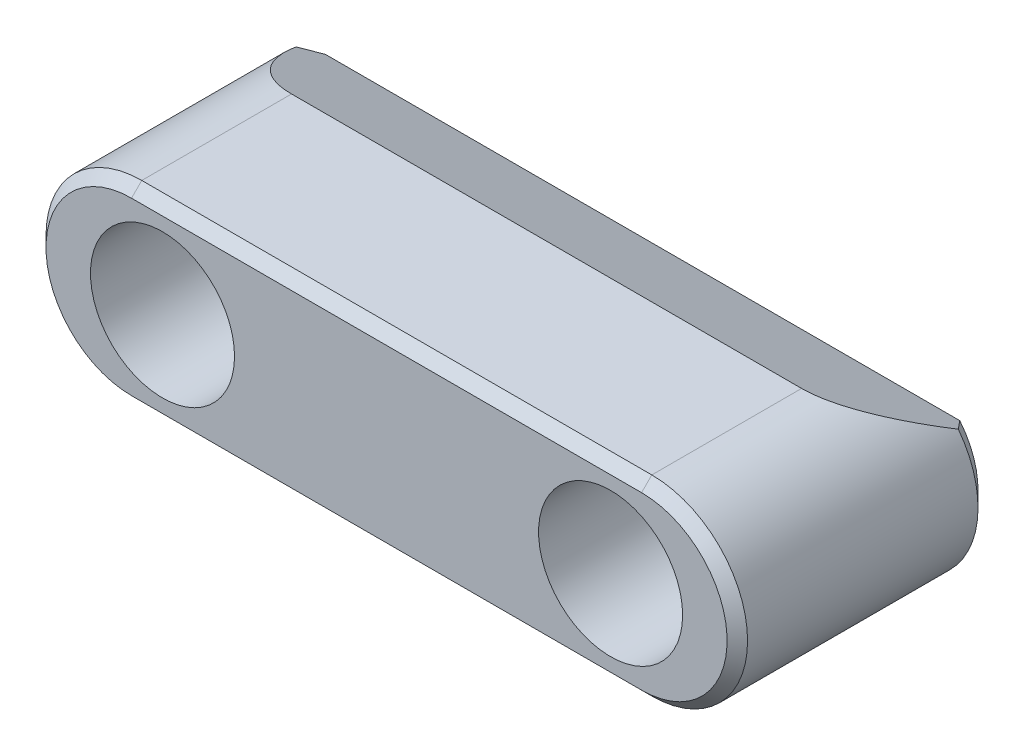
ISO-10303-21;
HEADER;
FILE_DESCRIPTION(('STEP AP214'),'2;1');
FILE_NAME('part.step','',(''),(''),'','','');
FILE_SCHEMA(('AUTOMOTIVE_DESIGN { 1 0 10303 214 1 1 1 1 }'));
ENDSEC;
DATA;
#1=APPLICATION_CONTEXT('core data for automotive mechanical design processes');
#2=APPLICATION_PROTOCOL_DEFINITION('international standard','automotive_design',2000,#1);
#3=PRODUCT_CONTEXT('',#1,'mechanical');
#4=PRODUCT('Part','Part','',(#3));
#5=PRODUCT_RELATED_PRODUCT_CATEGORY('part','',(#4));
#6=PRODUCT_DEFINITION_FORMATION('','',#4);
#7=PRODUCT_DEFINITION_CONTEXT('part definition',#1,'design');
#8=PRODUCT_DEFINITION('design','',#6,#7);
#9=PRODUCT_DEFINITION_SHAPE('','',#8);
#10=(LENGTH_UNIT() NAMED_UNIT(*) SI_UNIT(.MILLI.,.METRE.));
#11=(NAMED_UNIT(*) PLANE_ANGLE_UNIT() SI_UNIT($,.RADIAN.));
#12=(NAMED_UNIT(*) SI_UNIT($,.STERADIAN.) SOLID_ANGLE_UNIT());
#13=UNCERTAINTY_MEASURE_WITH_UNIT(LENGTH_MEASURE(1.E-05),#10,'distance_accuracy_value','');
#14=(GEOMETRIC_REPRESENTATION_CONTEXT(3) GLOBAL_UNCERTAINTY_ASSIGNED_CONTEXT((#13)) GLOBAL_UNIT_ASSIGNED_CONTEXT((#10,
#11,#12)) REPRESENTATION_CONTEXT('',''));
#15=CARTESIAN_POINT('',(0.,0.,0.));
#16=DIRECTION('',(0.,0.,1.));
#17=DIRECTION('',(1.,0.,0.));
#18=AXIS2_PLACEMENT_3D('',#15,#16,#17);
#19=CARTESIAN_POINT('',(-12.6492,0.,-12.7));
#20=DIRECTION('',(0.,0.,1.));
#21=DIRECTION('',(1.,0.,0.));
#22=AXIS2_PLACEMENT_3D('',#19,#20,#21);
#23=CYLINDRICAL_SURFACE('',#22,4.7498);
#24=CARTESIAN_POINT('',(-12.6492,0.,-18.1234789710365));
#25=DIRECTION('',(0.,-0.906307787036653,0.422618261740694));
#26=DIRECTION('',(0.,0.422618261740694,0.906307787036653));
#27=AXIS2_PLACEMENT_3D('',#24,#25,#26);
#28=ELLIPSE('',#27,11.2389842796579,4.7498);
#29=CARTESIAN_POINT('',(-16.4229520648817,2.88433621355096,-11.938));
#30=VERTEX_POINT('',#29);
#31=CARTESIAN_POINT('',(-12.6492,4.7498,-7.9375));
#32=VERTEX_POINT('',#31);
#33=EDGE_CURVE('E104',#30,#32,#28,.F.);
#34=ORIENTED_EDGE('',*,*,#33,.F.);
#35=CARTESIAN_POINT('',(-12.6492,0.,-11.938));
#36=DIRECTION('',(0.,0.,1.));
#37=DIRECTION('',(1.,0.,0.));
#38=AXIS2_PLACEMENT_3D('',#35,#36,#37);
#39=CIRCLE('',#38,4.7498);
#40=CARTESIAN_POINT('',(-12.6492,-4.7498,-11.938));
#41=VERTEX_POINT('',#40);
#42=EDGE_CURVE('E161',#30,#41,#39,.T.);
#43=ORIENTED_EDGE('',*,*,#42,.T.);
#44=DIRECTION('',(0.,0.,1.));
#45=VECTOR('',#44,1.);
#46=CARTESIAN_POINT('',(-12.6492,-4.7498,-12.7));
#47=LINE('',#46,#45);
#48=CARTESIAN_POINT('',(-12.6492,-4.7498,-0.508000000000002));
#49=VERTEX_POINT('',#48);
#50=EDGE_CURVE('E142',#41,#49,#47,.T.);
#51=ORIENTED_EDGE('',*,*,#50,.T.);
#52=CARTESIAN_POINT('',(-12.6492,0.,-0.508000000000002));
#53=DIRECTION('',(0.,0.,1.));
#54=DIRECTION('',(1.,0.,0.));
#55=AXIS2_PLACEMENT_3D('',#52,#53,#54);
#56=CIRCLE('',#55,4.7498);
#57=CARTESIAN_POINT('',(-12.6492,4.7498,-0.508000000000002));
#58=VERTEX_POINT('',#57);
#59=EDGE_CURVE('E129',#49,#58,#56,.F.);
#60=ORIENTED_EDGE('',*,*,#59,.T.);
#61=DIRECTION('',(0.,0.,1.));
#62=VECTOR('',#61,1.);
#63=CARTESIAN_POINT('',(-12.6492,4.7498,-12.7));
#64=LINE('',#63,#62);
#65=EDGE_CURVE('E122',#32,#58,#64,.T.);
#66=ORIENTED_EDGE('',*,*,#65,.F.);
#67=EDGE_LOOP('',(#34,#43,#51,#60,#66));
#68=FACE_BOUND('',#67,.T.);
#69=ADVANCED_FACE('F32',(#68),#23,.T.);
#70=CARTESIAN_POINT('',(-12.6492,4.7498,-12.7));
#71=DIRECTION('',(0.,1.,0.));
#72=DIRECTION('',(0.,0.,1.));
#73=AXIS2_PLACEMENT_3D('',#70,#71,#72);
#74=PLANE('',#73);
#75=ORIENTED_EDGE('',*,*,#65,.T.);
#76=DIRECTION('',(1.,0.,0.));
#77=VECTOR('',#76,1.);
#78=CARTESIAN_POINT('',(-12.6492,4.7498,-0.508000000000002));
#79=LINE('',#78,#77);
#80=CARTESIAN_POINT('',(12.6492,4.7498,-0.508000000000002));
#81=VERTEX_POINT('',#80);
#82=EDGE_CURVE('E159',#58,#81,#79,.T.);
#83=ORIENTED_EDGE('',*,*,#82,.T.);
#84=DIRECTION('',(0.,0.,1.));
#85=VECTOR('',#84,1.);
#86=CARTESIAN_POINT('',(12.6492,4.7498,-12.7));
#87=LINE('',#86,#85);
#88=CARTESIAN_POINT('',(12.6492,4.7498,-7.9375));
#89=VERTEX_POINT('',#88);
#90=EDGE_CURVE('E125',#89,#81,#87,.T.);
#91=ORIENTED_EDGE('',*,*,#90,.F.);
#92=DIRECTION('',(1.,0.,0.));
#93=VECTOR('',#92,1.);
#94=CARTESIAN_POINT('',(-17.399,4.7498,-7.9375));
#95=LINE('',#94,#93);
#96=EDGE_CURVE('E108',#32,#89,#95,.T.);
#97=ORIENTED_EDGE('',*,*,#96,.F.);
#98=EDGE_LOOP('',(#75,#83,#91,#97));
#99=FACE_BOUND('',#98,.T.);
#100=ADVANCED_FACE('F121',(#99),#74,.T.);
#101=CARTESIAN_POINT('',(12.6492,0.,-12.7));
#102=DIRECTION('',(0.,0.,1.));
#103=DIRECTION('',(1.,0.,0.));
#104=AXIS2_PLACEMENT_3D('',#101,#102,#103);
#105=CYLINDRICAL_SURFACE('',#104,4.7498);
#106=DIRECTION('',(0.,0.,1.));
#107=VECTOR('',#106,1.);
#108=CARTESIAN_POINT('',(12.6492,-4.7498,-12.7));
#109=LINE('',#108,#107);
#110=CARTESIAN_POINT('',(12.6492,-4.7498,-11.938));
#111=VERTEX_POINT('',#110);
#112=CARTESIAN_POINT('',(12.6492,-4.7498,-0.508000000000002));
#113=VERTEX_POINT('',#112);
#114=EDGE_CURVE('E135',#111,#113,#109,.T.);
#115=ORIENTED_EDGE('',*,*,#114,.F.);
#116=CARTESIAN_POINT('',(12.6492,0.,-11.938));
#117=DIRECTION('',(0.,0.,1.));
#118=DIRECTION('',(1.,0.,0.));
#119=AXIS2_PLACEMENT_3D('',#116,#117,#118);
#120=CIRCLE('',#119,4.7498);
#121=CARTESIAN_POINT('',(16.4229520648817,2.88433621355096,-11.938));
#122=VERTEX_POINT('',#121);
#123=EDGE_CURVE('E42',#111,#122,#120,.T.);
#124=ORIENTED_EDGE('',*,*,#123,.T.);
#125=CARTESIAN_POINT('',(12.6492,0.,-18.1234789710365));
#126=DIRECTION('',(0.,-0.906307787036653,0.422618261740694));
#127=DIRECTION('',(0.,0.422618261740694,0.906307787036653));
#128=AXIS2_PLACEMENT_3D('',#125,#126,#127);
#129=ELLIPSE('',#128,11.2389842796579,4.7498);
#130=EDGE_CURVE('E116',#89,#122,#129,.F.);
#131=ORIENTED_EDGE('',*,*,#130,.F.);
#132=ORIENTED_EDGE('',*,*,#90,.T.);
#133=CARTESIAN_POINT('',(12.6492,0.,-0.508000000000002));
#134=DIRECTION('',(0.,0.,1.));
#135=DIRECTION('',(1.,0.,0.));
#136=AXIS2_PLACEMENT_3D('',#133,#134,#135);
#137=CIRCLE('',#136,4.7498);
#138=EDGE_CURVE('E155',#81,#113,#137,.F.);
#139=ORIENTED_EDGE('',*,*,#138,.T.);
#140=EDGE_LOOP('',(#115,#124,#131,#132,#139));
#141=FACE_BOUND('',#140,.T.);
#142=ADVANCED_FACE('F230',(#141),#105,.T.);
#143=CARTESIAN_POINT('',(-12.6492,-4.7498,-12.7));
#144=DIRECTION('',(0.,-1.,0.));
#145=DIRECTION('',(0.,0.,-1.));
#146=AXIS2_PLACEMENT_3D('',#143,#144,#145);
#147=PLANE('',#146);
#148=ORIENTED_EDGE('',*,*,#50,.F.);
#149=DIRECTION('',(1.,0.,0.));
#150=VECTOR('',#149,1.);
#151=CARTESIAN_POINT('',(12.6492,-4.7498,-11.938));
#152=LINE('',#151,#150);
#153=EDGE_CURVE('E11',#41,#111,#152,.T.);
#154=ORIENTED_EDGE('',*,*,#153,.T.);
#155=ORIENTED_EDGE('',*,*,#114,.T.);
#156=DIRECTION('',(-1.,0.,0.));
#157=VECTOR('',#156,1.);
#158=CARTESIAN_POINT('',(-12.6492,-4.7498,-0.508000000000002));
#159=LINE('',#158,#157);
#160=EDGE_CURVE('E152',#113,#49,#159,.T.);
#161=ORIENTED_EDGE('',*,*,#160,.T.);
#162=EDGE_LOOP('',(#148,#154,#155,#161));
#163=FACE_BOUND('',#162,.T.);
#164=ADVANCED_FACE('F223',(#163),#147,.T.);
#165=CARTESIAN_POINT('',(-12.6492,0.,-12.7));
#166=DIRECTION('',(0.,0.,1.));
#167=DIRECTION('',(1.,0.,0.));
#168=AXIS2_PLACEMENT_3D('',#165,#166,#167);
#169=PLANE('',#168);
#170=CARTESIAN_POINT('',(-11.1125,0.,-12.7));
#171=DIRECTION('',(0.,0.,1.));
#172=DIRECTION('',(1.,0.,0.));
#173=AXIS2_PLACEMENT_3D('',#170,#171,#172);
#174=CIRCLE('',#173,2.15265);
#175=CARTESIAN_POINT('',(-8.95985,0.,-12.7));
#176=VERTEX_POINT('',#175);
#177=EDGE_CURVE('E281',#176,#176,#174,.T.);
#178=ORIENTED_EDGE('',*,*,#177,.T.);
#179=EDGE_LOOP('',(#178));
#180=FACE_BOUND('',#179,.T.);
#181=CARTESIAN_POINT('',(11.1125,0.,-12.7));
#182=DIRECTION('',(0.,0.,1.));
#183=DIRECTION('',(1.,0.,0.));
#184=AXIS2_PLACEMENT_3D('',#181,#182,#183);
#185=CIRCLE('',#184,2.15265);
#186=CARTESIAN_POINT('',(13.26515,0.,-12.7));
#187=VERTEX_POINT('',#186);
#188=EDGE_CURVE('E138',#187,#187,#185,.T.);
#189=ORIENTED_EDGE('',*,*,#188,.T.);
#190=EDGE_LOOP('',(#189));
#191=FACE_BOUND('',#190,.T.);
#192=DIRECTION('',(-1.,0.,0.));
#193=VECTOR('',#192,1.);
#194=CARTESIAN_POINT('',(-12.6492,-3.9878,-12.7));
#195=LINE('',#194,#193);
#196=CARTESIAN_POINT('',(12.6492,-3.9878,-12.7));
#197=VERTEX_POINT('',#196);
#198=CARTESIAN_POINT('',(-12.6492,-3.9878,-12.7));
#199=VERTEX_POINT('',#198);
#200=EDGE_CURVE('E173',#197,#199,#195,.T.);
#201=ORIENTED_EDGE('',*,*,#200,.T.);
#202=CARTESIAN_POINT('',(-12.6492,0.,-12.7));
#203=DIRECTION('',(0.,0.,1.));
#204=DIRECTION('',(1.,0.,0.));
#205=AXIS2_PLACEMENT_3D('',#202,#203,#204);
#206=CIRCLE('',#205,3.9878);
#207=CARTESIAN_POINT('',(-15.7324869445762,2.52900977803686,-12.7));
#208=VERTEX_POINT('',#207);
#209=EDGE_CURVE('E177',#199,#208,#206,.F.);
#210=ORIENTED_EDGE('',*,*,#209,.T.);
#211=DIRECTION('',(1.,0.,0.));
#212=VECTOR('',#211,1.);
#213=CARTESIAN_POINT('',(-12.6492,2.52900977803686,-12.7));
#214=LINE('',#213,#212);
#215=CARTESIAN_POINT('',(15.7324869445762,2.52900977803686,-12.7));
#216=VERTEX_POINT('',#215);
#217=EDGE_CURVE('E130',#208,#216,#214,.T.);
#218=ORIENTED_EDGE('',*,*,#217,.T.);
#219=CARTESIAN_POINT('',(12.6492,0.,-12.7));
#220=DIRECTION('',(0.,0.,1.));
#221=DIRECTION('',(1.,0.,0.));
#222=AXIS2_PLACEMENT_3D('',#219,#220,#221);
#223=CIRCLE('',#222,3.9878);
#224=EDGE_CURVE('E175',#216,#197,#223,.F.);
#225=ORIENTED_EDGE('',*,*,#224,.T.);
#226=EDGE_LOOP('',(#201,#210,#218,#225));
#227=FACE_BOUND('',#226,.T.);
#228=ADVANCED_FACE('F220',(#180,#191,#227),#169,.F.);
#229=CARTESIAN_POINT('',(-12.6492,0.,0.));
#230=DIRECTION('',(0.,0.,1.));
#231=DIRECTION('',(1.,0.,0.));
#232=AXIS2_PLACEMENT_3D('',#229,#230,#231);
#233=PLANE('',#232);
#234=CARTESIAN_POINT('',(-12.6492,0.,0.));
#235=DIRECTION('',(0.,0.,1.));
#236=DIRECTION('',(1.,0.,0.));
#237=AXIS2_PLACEMENT_3D('',#234,#235,#236);
#238=CIRCLE('',#237,4.2418);
#239=CARTESIAN_POINT('',(-12.6492,4.2418,0.));
#240=VERTEX_POINT('',#239);
#241=CARTESIAN_POINT('',(-12.6492,-4.2418,0.));
#242=VERTEX_POINT('',#241);
#243=EDGE_CURVE('E145',#240,#242,#238,.T.);
#244=ORIENTED_EDGE('',*,*,#243,.T.);
#245=DIRECTION('',(1.,0.,0.));
#246=VECTOR('',#245,1.);
#247=CARTESIAN_POINT('',(-12.6492,-4.2418,0.));
#248=LINE('',#247,#246);
#249=CARTESIAN_POINT('',(12.6492,-4.2418,0.));
#250=VERTEX_POINT('',#249);
#251=EDGE_CURVE('E149',#242,#250,#248,.T.);
#252=ORIENTED_EDGE('',*,*,#251,.T.);
#253=CARTESIAN_POINT('',(12.6492,0.,0.));
#254=DIRECTION('',(0.,0.,1.));
#255=DIRECTION('',(1.,0.,0.));
#256=AXIS2_PLACEMENT_3D('',#253,#254,#255);
#257=CIRCLE('',#256,4.2418);
#258=CARTESIAN_POINT('',(12.6492,4.2418,0.));
#259=VERTEX_POINT('',#258);
#260=EDGE_CURVE('E147',#250,#259,#257,.T.);
#261=ORIENTED_EDGE('',*,*,#260,.T.);
#262=DIRECTION('',(-1.,0.,0.));
#263=VECTOR('',#262,1.);
#264=CARTESIAN_POINT('',(-12.6492,4.2418,0.));
#265=LINE('',#264,#263);
#266=EDGE_CURVE('E133',#259,#240,#265,.T.);
#267=ORIENTED_EDGE('',*,*,#266,.T.);
#268=EDGE_LOOP('',(#244,#252,#261,#267));
#269=FACE_BOUND('',#268,.T.);
#270=CARTESIAN_POINT('',(-11.1125,0.,0.));
#271=DIRECTION('',(0.,0.,1.));
#272=DIRECTION('',(1.,0.,0.));
#273=AXIS2_PLACEMENT_3D('',#270,#271,#272);
#274=CIRCLE('',#273,3.57251);
#275=CARTESIAN_POINT('',(-7.53999,0.,0.));
#276=VERTEX_POINT('',#275);
#277=EDGE_CURVE('E115',#276,#276,#274,.T.);
#278=ORIENTED_EDGE('',*,*,#277,.F.);
#279=EDGE_LOOP('',(#278));
#280=FACE_BOUND('',#279,.T.);
#281=CARTESIAN_POINT('',(11.1125,0.,0.));
#282=DIRECTION('',(0.,0.,1.));
#283=DIRECTION('',(1.,0.,0.));
#284=AXIS2_PLACEMENT_3D('',#281,#282,#283);
#285=CIRCLE('',#284,3.57251);
#286=CARTESIAN_POINT('',(14.68501,0.,0.));
#287=VERTEX_POINT('',#286);
#288=EDGE_CURVE('E284',#287,#287,#285,.T.);
#289=ORIENTED_EDGE('',*,*,#288,.F.);
#290=EDGE_LOOP('',(#289));
#291=FACE_BOUND('',#290,.T.);
#292=ADVANCED_FACE('F218',(#269,#280,#291),#233,.T.);
#293=CARTESIAN_POINT('',(11.1125,0.,0.));
#294=DIRECTION('',(0.,0.,1.));
#295=DIRECTION('',(1.,0.,0.));
#296=AXIS2_PLACEMENT_3D('',#293,#294,#295);
#297=CYLINDRICAL_SURFACE('',#296,2.15265);
#298=ORIENTED_EDGE('',*,*,#188,.F.);
#299=EDGE_LOOP('',(#298));
#300=FACE_BOUND('',#299,.T.);
#301=CARTESIAN_POINT('',(11.1125,0.,-5.08));
#302=DIRECTION('',(0.,0.,1.));
#303=DIRECTION('',(1.,0.,0.));
#304=AXIS2_PLACEMENT_3D('',#301,#302,#303);
#305=CIRCLE('',#304,2.15265);
#306=CARTESIAN_POINT('',(13.26515,0.,-5.08));
#307=VERTEX_POINT('',#306);
#308=EDGE_CURVE('E289',#307,#307,#305,.T.);
#309=ORIENTED_EDGE('',*,*,#308,.T.);
#310=EDGE_LOOP('',(#309));
#311=FACE_BOUND('',#310,.T.);
#312=ADVANCED_FACE('F214',(#300,#311),#297,.F.);
#313=CARTESIAN_POINT('',(13.26515,0.,-5.08));
#314=DIRECTION('',(0.,0.,-1.));
#315=DIRECTION('',(-1.,0.,0.));
#316=AXIS2_PLACEMENT_3D('',#313,#314,#315);
#317=PLANE('',#316);
#318=ORIENTED_EDGE('',*,*,#308,.F.);
#319=EDGE_LOOP('',(#318));
#320=FACE_BOUND('',#319,.T.);
#321=CARTESIAN_POINT('',(11.1125,0.,-5.08));
#322=DIRECTION('',(0.,0.,1.));
#323=DIRECTION('',(1.,0.,0.));
#324=AXIS2_PLACEMENT_3D('',#321,#322,#323);
#325=CIRCLE('',#324,3.57251);
#326=CARTESIAN_POINT('',(14.68501,0.,-5.08));
#327=VERTEX_POINT('',#326);
#328=EDGE_CURVE('E287',#327,#327,#325,.T.);
#329=ORIENTED_EDGE('',*,*,#328,.T.);
#330=EDGE_LOOP('',(#329));
#331=FACE_BOUND('',#330,.T.);
#332=ADVANCED_FACE('F210',(#320,#331),#317,.F.);
#333=CARTESIAN_POINT('',(11.1125,0.,0.));
#334=DIRECTION('',(0.,0.,1.));
#335=DIRECTION('',(1.,0.,0.));
#336=AXIS2_PLACEMENT_3D('',#333,#334,#335);
#337=CYLINDRICAL_SURFACE('',#336,3.57251);
#338=ORIENTED_EDGE('',*,*,#328,.F.);
#339=EDGE_LOOP('',(#338));
#340=FACE_BOUND('',#339,.T.);
#341=ORIENTED_EDGE('',*,*,#288,.T.);
#342=EDGE_LOOP('',(#341));
#343=FACE_BOUND('',#342,.T.);
#344=ADVANCED_FACE('F206',(#340,#343),#337,.F.);
#345=CARTESIAN_POINT('',(-11.1125,0.,0.));
#346=DIRECTION('',(0.,0.,1.));
#347=DIRECTION('',(1.,0.,0.));
#348=AXIS2_PLACEMENT_3D('',#345,#346,#347);
#349=CYLINDRICAL_SURFACE('',#348,2.15265);
#350=ORIENTED_EDGE('',*,*,#177,.F.);
#351=EDGE_LOOP('',(#350));
#352=FACE_BOUND('',#351,.T.);
#353=CARTESIAN_POINT('',(-11.1125,0.,-5.08));
#354=DIRECTION('',(0.,0.,1.));
#355=DIRECTION('',(1.,0.,0.));
#356=AXIS2_PLACEMENT_3D('',#353,#354,#355);
#357=CIRCLE('',#356,2.15265);
#358=CARTESIAN_POINT('',(-8.95985,0.,-5.08));
#359=VERTEX_POINT('',#358);
#360=EDGE_CURVE('E278',#359,#359,#357,.T.);
#361=ORIENTED_EDGE('',*,*,#360,.T.);
#362=EDGE_LOOP('',(#361));
#363=FACE_BOUND('',#362,.T.);
#364=ADVANCED_FACE('F202',(#352,#363),#349,.F.);
#365=CARTESIAN_POINT('',(-8.95985,0.,-5.08));
#366=DIRECTION('',(0.,0.,-1.));
#367=DIRECTION('',(-1.,0.,0.));
#368=AXIS2_PLACEMENT_3D('',#365,#366,#367);
#369=PLANE('',#368);
#370=ORIENTED_EDGE('',*,*,#360,.F.);
#371=EDGE_LOOP('',(#370));
#372=FACE_BOUND('',#371,.T.);
#373=CARTESIAN_POINT('',(-11.1125,0.,-5.08));
#374=DIRECTION('',(0.,0.,1.));
#375=DIRECTION('',(1.,0.,0.));
#376=AXIS2_PLACEMENT_3D('',#373,#374,#375);
#377=CIRCLE('',#376,3.57251);
#378=CARTESIAN_POINT('',(-7.53999,0.,-5.08));
#379=VERTEX_POINT('',#378);
#380=EDGE_CURVE('E275',#379,#379,#377,.T.);
#381=ORIENTED_EDGE('',*,*,#380,.T.);
#382=EDGE_LOOP('',(#381));
#383=FACE_BOUND('',#382,.T.);
#384=ADVANCED_FACE('F198',(#372,#383),#369,.F.);
#385=CARTESIAN_POINT('',(-11.1125,0.,0.));
#386=DIRECTION('',(0.,0.,1.));
#387=DIRECTION('',(1.,0.,0.));
#388=AXIS2_PLACEMENT_3D('',#385,#386,#387);
#389=CYLINDRICAL_SURFACE('',#388,3.57251);
#390=ORIENTED_EDGE('',*,*,#380,.F.);
#391=EDGE_LOOP('',(#390));
#392=FACE_BOUND('',#391,.T.);
#393=ORIENTED_EDGE('',*,*,#277,.T.);
#394=EDGE_LOOP('',(#393));
#395=FACE_BOUND('',#394,.T.);
#396=ADVANCED_FACE('F194',(#392,#395),#389,.F.);
#397=CARTESIAN_POINT('',(-17.399,4.7498,-7.9375));
#398=DIRECTION('',(0.,-0.906307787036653,0.422618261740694));
#399=DIRECTION('',(0.,-0.422618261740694,-0.906307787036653));
#400=AXIS2_PLACEMENT_3D('',#397,#398,#399);
#401=PLANE('',#400);
#402=ORIENTED_EDGE('',*,*,#217,.F.);
#403=CARTESIAN_POINT('',(-15.7324869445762,2.52900977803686,-12.7));
#404=CARTESIAN_POINT('',(-15.847888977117,2.58811823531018,-12.5732415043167));
#405=CARTESIAN_POINT('',(-15.9631287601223,2.64728300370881,-12.4463622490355));
#406=CARTESIAN_POINT('',(-16.1932838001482,2.76572514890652,-12.192362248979));
#407=CARTESIAN_POINT('',(-16.3081990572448,2.82500252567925,-12.0652415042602));
#408=CARTESIAN_POINT('',(-16.4229520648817,2.88433621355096,-11.938));
#409=B_SPLINE_CURVE_WITH_KNOTS('',3,(#403,#404,#405,#406,#407,#408),.UNSPECIFIED.,.F.,.F.,(4,2,
4),(0.,0.543977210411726,1.08795429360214),.UNSPECIFIED.);
#410=EDGE_CURVE('E110',#208,#30,#409,.T.);
#411=ORIENTED_EDGE('',*,*,#410,.T.);
#412=ORIENTED_EDGE('',*,*,#33,.T.);
#413=ORIENTED_EDGE('',*,*,#96,.T.);
#414=ORIENTED_EDGE('',*,*,#130,.T.);
#415=CARTESIAN_POINT('',(16.4229520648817,2.88433621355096,-11.938));
#416=CARTESIAN_POINT('',(16.3081990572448,2.82500252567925,-12.0652415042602));
#417=CARTESIAN_POINT('',(16.1932838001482,2.76572514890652,-12.192362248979));
#418=CARTESIAN_POINT('',(15.9631287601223,2.64728300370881,-12.4463622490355));
#419=CARTESIAN_POINT('',(15.847888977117,2.58811823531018,-12.5732415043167));
#420=CARTESIAN_POINT('',(15.7324869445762,2.52900977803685,-12.7));
#421=B_SPLINE_CURVE_WITH_KNOTS('',3,(#415,#416,#417,#418,#419,#420),.UNSPECIFIED.,.F.,.F.,(4,2,
4),(0.,0.543977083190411,1.08795429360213),.UNSPECIFIED.);
#422=EDGE_CURVE('E179',#122,#216,#421,.T.);
#423=ORIENTED_EDGE('',*,*,#422,.T.);
#424=EDGE_LOOP('',(#402,#411,#412,#413,#414,#423));
#425=FACE_BOUND('',#424,.T.);
#426=ADVANCED_FACE('F107',(#425),#401,.F.);
#427=CARTESIAN_POINT('',(-12.6492,4.2418,0.));
#428=DIRECTION('',(0.,-0.707106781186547,-0.707106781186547));
#429=DIRECTION('',(-1.,0.,0.));
#430=AXIS2_PLACEMENT_3D('',#427,#428,#429);
#431=PLANE('',#430);
#432=DIRECTION('',(0.,-0.707106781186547,0.707106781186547));
#433=VECTOR('',#432,1.);
#434=CARTESIAN_POINT('',(12.6492,4.7498,-0.508000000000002));
#435=LINE('',#434,#433);
#436=EDGE_CURVE('E167',#81,#259,#435,.T.);
#437=ORIENTED_EDGE('',*,*,#436,.F.);
#438=ORIENTED_EDGE('',*,*,#82,.F.);
#439=DIRECTION('',(0.,0.707106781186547,-0.707106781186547));
#440=VECTOR('',#439,1.);
#441=CARTESIAN_POINT('',(-12.6492,4.2418,0.));
#442=LINE('',#441,#440);
#443=EDGE_CURVE('E126',#240,#58,#442,.T.);
#444=ORIENTED_EDGE('',*,*,#443,.F.);
#445=ORIENTED_EDGE('',*,*,#266,.F.);
#446=EDGE_LOOP('',(#437,#438,#444,#445));
#447=FACE_BOUND('',#446,.T.);
#448=ADVANCED_FACE('F193',(#447),#431,.F.);
#449=CARTESIAN_POINT('',(-12.6492,0.,0.));
#450=DIRECTION('',(0.,0.,-1.));
#451=DIRECTION('',(-1.,0.,0.));
#452=AXIS2_PLACEMENT_3D('',#449,#450,#451);
#453=CONICAL_SURFACE('',#452,4.2418,0.785398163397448);
#454=ORIENTED_EDGE('',*,*,#443,.T.);
#455=ORIENTED_EDGE('',*,*,#59,.F.);
#456=DIRECTION('',(0.,-0.707106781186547,-0.707106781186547));
#457=VECTOR('',#456,1.);
#458=CARTESIAN_POINT('',(-12.6492,-4.2418,0.));
#459=LINE('',#458,#457);
#460=EDGE_CURVE('E164',#242,#49,#459,.T.);
#461=ORIENTED_EDGE('',*,*,#460,.F.);
#462=ORIENTED_EDGE('',*,*,#243,.F.);
#463=EDGE_LOOP('',(#454,#455,#461,#462));
#464=FACE_BOUND('',#463,.T.);
#465=ADVANCED_FACE('F244',(#464),#453,.T.);
#466=CARTESIAN_POINT('',(12.6492,0.,0.));
#467=DIRECTION('',(0.,0.,-1.));
#468=DIRECTION('',(-1.,0.,0.));
#469=AXIS2_PLACEMENT_3D('',#466,#467,#468);
#470=CONICAL_SURFACE('',#469,4.2418,0.785398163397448);
#471=ORIENTED_EDGE('',*,*,#436,.T.);
#472=ORIENTED_EDGE('',*,*,#260,.F.);
#473=DIRECTION('',(0.,0.707106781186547,0.707106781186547));
#474=VECTOR('',#473,1.);
#475=CARTESIAN_POINT('',(12.6492,-4.7498,-0.508000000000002));
#476=LINE('',#475,#474);
#477=EDGE_CURVE('E162',#113,#250,#476,.T.);
#478=ORIENTED_EDGE('',*,*,#477,.F.);
#479=ORIENTED_EDGE('',*,*,#138,.F.);
#480=EDGE_LOOP('',(#471,#472,#478,#479));
#481=FACE_BOUND('',#480,.T.);
#482=ADVANCED_FACE('F240',(#481),#470,.T.);
#483=CARTESIAN_POINT('',(-12.6492,-4.2418,0.));
#484=DIRECTION('',(0.,0.707106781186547,-0.707106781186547));
#485=DIRECTION('',(1.,0.,0.));
#486=AXIS2_PLACEMENT_3D('',#483,#484,#485);
#487=PLANE('',#486);
#488=ORIENTED_EDGE('',*,*,#460,.T.);
#489=ORIENTED_EDGE('',*,*,#160,.F.);
#490=ORIENTED_EDGE('',*,*,#477,.T.);
#491=ORIENTED_EDGE('',*,*,#251,.F.);
#492=EDGE_LOOP('',(#488,#489,#490,#491));
#493=FACE_BOUND('',#492,.T.);
#494=ADVANCED_FACE('F237',(#493),#487,.F.);
#495=CARTESIAN_POINT('',(12.6492,0.,-11.938));
#496=DIRECTION('',(0.,0.,1.));
#497=DIRECTION('',(1.,0.,0.));
#498=AXIS2_PLACEMENT_3D('',#495,#496,#497);
#499=CONICAL_SURFACE('',#498,4.7498,0.785398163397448);
#500=ORIENTED_EDGE('',*,*,#422,.F.);
#501=ORIENTED_EDGE('',*,*,#123,.F.);
#502=DIRECTION('',(0.,-0.707106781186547,0.707106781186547));
#503=VECTOR('',#502,1.);
#504=CARTESIAN_POINT('',(12.6492,-3.9878,-12.7));
#505=LINE('',#504,#503);
#506=EDGE_CURVE('E37',#197,#111,#505,.T.);
#507=ORIENTED_EDGE('',*,*,#506,.F.);
#508=ORIENTED_EDGE('',*,*,#224,.F.);
#509=EDGE_LOOP('',(#500,#501,#507,#508));
#510=FACE_BOUND('',#509,.T.);
#511=ADVANCED_FACE('F34',(#510),#499,.T.);
#512=CARTESIAN_POINT('',(-12.6492,-4.7498,-11.938));
#513=DIRECTION('',(0.,-0.707106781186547,-0.707106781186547));
#514=DIRECTION('',(-1.,0.,0.));
#515=AXIS2_PLACEMENT_3D('',#512,#513,#514);
#516=PLANE('',#515);
#517=ORIENTED_EDGE('',*,*,#506,.T.);
#518=ORIENTED_EDGE('',*,*,#153,.F.);
#519=DIRECTION('',(0.,-0.707106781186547,0.707106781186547));
#520=VECTOR('',#519,1.);
#521=CARTESIAN_POINT('',(-12.6492,-3.9878,-12.7));
#522=LINE('',#521,#520);
#523=EDGE_CURVE('E267',#199,#41,#522,.T.);
#524=ORIENTED_EDGE('',*,*,#523,.F.);
#525=ORIENTED_EDGE('',*,*,#200,.F.);
#526=EDGE_LOOP('',(#517,#518,#524,#525));
#527=FACE_BOUND('',#526,.T.);
#528=ADVANCED_FACE('F254',(#527),#516,.T.);
#529=CARTESIAN_POINT('',(-12.6492,0.,-11.938));
#530=DIRECTION('',(0.,0.,1.));
#531=DIRECTION('',(1.,0.,0.));
#532=AXIS2_PLACEMENT_3D('',#529,#530,#531);
#533=CONICAL_SURFACE('',#532,4.7498,0.785398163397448);
#534=ORIENTED_EDGE('',*,*,#410,.F.);
#535=ORIENTED_EDGE('',*,*,#209,.F.);
#536=ORIENTED_EDGE('',*,*,#523,.T.);
#537=ORIENTED_EDGE('',*,*,#42,.F.);
#538=EDGE_LOOP('',(#534,#535,#536,#537));
#539=FACE_BOUND('',#538,.T.);
#540=ADVANCED_FACE('F251',(#539),#533,.T.);
#541=CLOSED_SHELL('',(#69,#100,#142,#164,#228,#292,#312,#332,#344,#364,#384,#396,#426,#448,#465,
#482,#494,#511,#528,#540));
#542=MANIFOLD_SOLID_BREP('B2',#541);
#543=ADVANCED_BREP_SHAPE_REPRESENTATION('',(#18,#542),#14);
#544=SHAPE_DEFINITION_REPRESENTATION(#9,#543);
ENDSEC;
END-ISO-10303-21;
